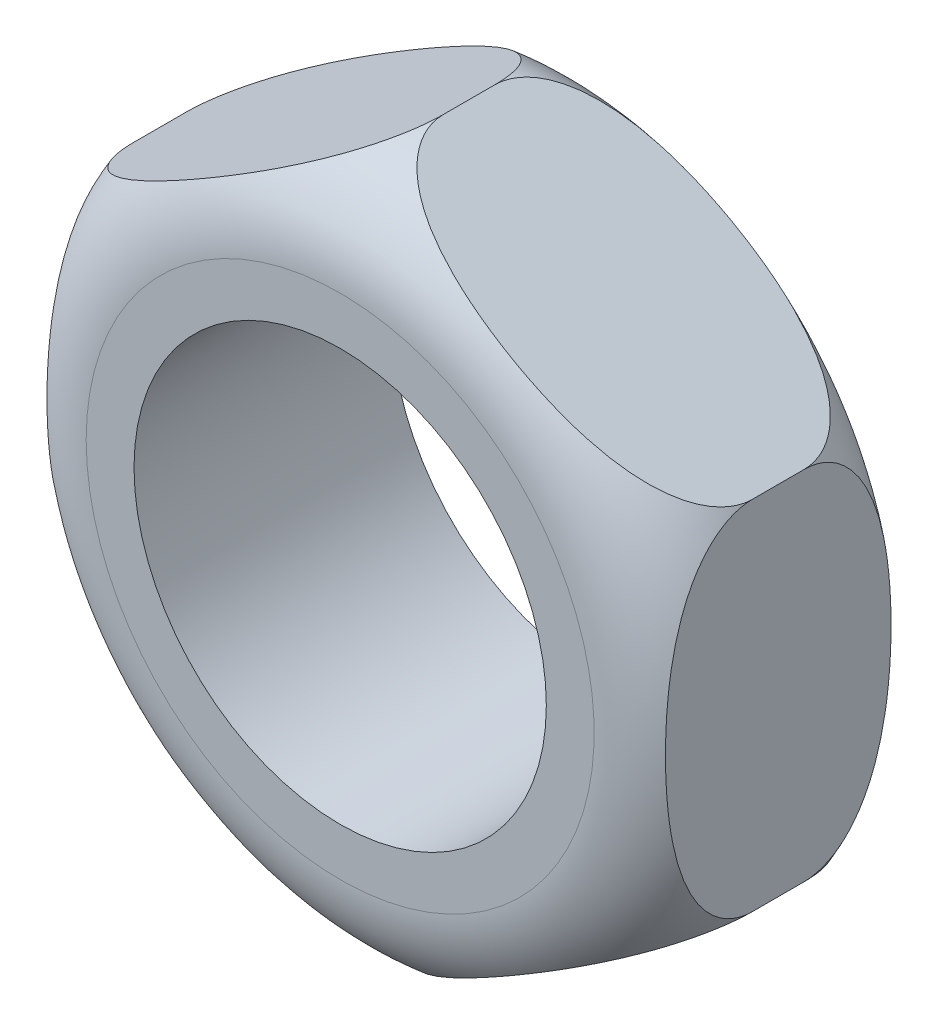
from build123d import *

# Parameters (mm, degrees)
SKETCH1_R      = 4
EXTRUDE1_DEPTH = 5


with BuildPart() as part:
    # Sketch1 → Extrude1 (new body)
    with BuildSketch(Plane.XY):
        Polygon((0, -28.07179677), (-6, -31.535898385), (-6, -38.464101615), (0, -41.92820323), (6, -38.464101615), (6, -31.535898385), align=None)
        with Locations((0, -35)):
            Circle(SKETCH1_R, mode=Mode.SUBTRACT)
    extrude(amount=EXTRUDE1_DEPTH)

    # Sketch2 → Cut-Revolve1 (revolve, cut)
    with BuildSketch(Plane(origin=(0, 0, 0), x_dir=(0, 0, -1), z_dir=(1, 0, 0)), mode=Mode.PRIVATE) as cut_revolve1_sk:
        with BuildLine():
            Line((0, -30.07179677), (1.30827939, -30.07179677))
            Line((1.30827939, -30.07179677), (1.30827939, -25.335057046))
            Line((1.30827939, -25.335057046), (-2, -25.335057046))
            Line((-2, -25.335057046), (-2, -28.07179677))
            ThreePointArc((-2, -28.07179677), (-0.585786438, -28.657583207), (0, -30.07179677))
        make_face()
        with BuildLine():
            Line((-3, -25.335057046), (-3, -28.07179677))
            ThreePointArc((-3, -28.07179677), (-4.414213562, -28.657583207), (-5, -30.07179677))
            Line((-5, -30.07179677), (-6.30827939, -30.07179677))
            Line((-6.30827939, -30.07179677), (-6.30827939, -25.335057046))
            Line((-6.30827939, -25.335057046), (-3, -25.335057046))
        make_face()
    revolve(cut_revolve1_sk.sketch.rotate(Axis((0, -35, -7), (0, 0, 1)), 90), axis=Axis((0, -35, -7), (0, 0, 1)), mode=Mode.SUBTRACT)


solid = part.part
